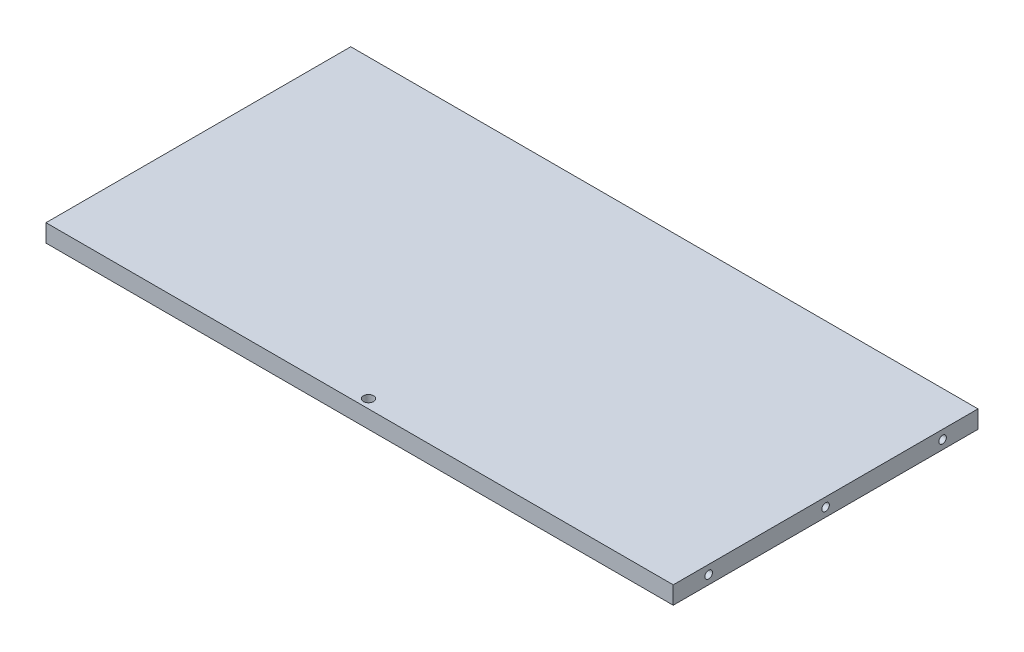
ISO-10303-21;
HEADER;
FILE_DESCRIPTION(('STEP AP214'),'2;1');
FILE_NAME('part.step','',(''),(''),'','','');
FILE_SCHEMA(('AUTOMOTIVE_DESIGN { 1 0 10303 214 1 1 1 1 }'));
ENDSEC;
DATA;
#1=APPLICATION_CONTEXT('core data for automotive mechanical design processes');
#2=APPLICATION_PROTOCOL_DEFINITION('international standard','automotive_design',2000,#1);
#3=PRODUCT_CONTEXT('',#1,'mechanical');
#4=PRODUCT('Part','Part','',(#3));
#5=PRODUCT_RELATED_PRODUCT_CATEGORY('part','',(#4));
#6=PRODUCT_DEFINITION_FORMATION('','',#4);
#7=PRODUCT_DEFINITION_CONTEXT('part definition',#1,'design');
#8=PRODUCT_DEFINITION('design','',#6,#7);
#9=PRODUCT_DEFINITION_SHAPE('','',#8);
#10=(LENGTH_UNIT() NAMED_UNIT(*) SI_UNIT(.MILLI.,.METRE.));
#11=(NAMED_UNIT(*) PLANE_ANGLE_UNIT() SI_UNIT($,.RADIAN.));
#12=(NAMED_UNIT(*) SI_UNIT($,.STERADIAN.) SOLID_ANGLE_UNIT());
#13=UNCERTAINTY_MEASURE_WITH_UNIT(LENGTH_MEASURE(1.E-05),#10,'distance_accuracy_value','');
#14=(GEOMETRIC_REPRESENTATION_CONTEXT(3) GLOBAL_UNCERTAINTY_ASSIGNED_CONTEXT((#13)) GLOBAL_UNIT_ASSIGNED_CONTEXT((#10,
#11,#12)) REPRESENTATION_CONTEXT('',''));
#15=CARTESIAN_POINT('',(0.,0.,0.));
#16=DIRECTION('',(0.,0.,1.));
#17=DIRECTION('',(1.,0.,0.));
#18=AXIS2_PLACEMENT_3D('',#15,#16,#17);
#19=CARTESIAN_POINT('',(-112.395,6.35,-54.61));
#20=DIRECTION('',(1.,0.,0.));
#21=DIRECTION('',(0.,0.,-1.));
#22=AXIS2_PLACEMENT_3D('',#19,#20,#21);
#23=PLANE('',#22);
#24=CARTESIAN_POINT('',(-112.395,3.175,41.91));
#25=DIRECTION('',(-1.,0.,0.));
#26=DIRECTION('',(0.,0.,1.));
#27=AXIS2_PLACEMENT_3D('',#24,#25,#26);
#28=CIRCLE('',#27,1.35255);
#29=CARTESIAN_POINT('',(-112.395,3.175,43.26255));
#30=VERTEX_POINT('',#29);
#31=EDGE_CURVE('E114',#30,#30,#28,.T.);
#32=ORIENTED_EDGE('',*,*,#31,.F.);
#33=EDGE_LOOP('',(#32));
#34=FACE_BOUND('',#33,.T.);
#35=CARTESIAN_POINT('',(-112.395,3.175,0.));
#36=DIRECTION('',(-1.,0.,0.));
#37=DIRECTION('',(0.,0.,1.));
#38=AXIS2_PLACEMENT_3D('',#35,#36,#37);
#39=CIRCLE('',#38,1.35255);
#40=CARTESIAN_POINT('',(-112.395,3.175,1.35255000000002));
#41=VERTEX_POINT('',#40);
#42=EDGE_CURVE('E113',#41,#41,#39,.T.);
#43=ORIENTED_EDGE('',*,*,#42,.F.);
#44=EDGE_LOOP('',(#43));
#45=FACE_BOUND('',#44,.T.);
#46=CARTESIAN_POINT('',(-112.395,3.175,-41.91));
#47=DIRECTION('',(-1.,0.,0.));
#48=DIRECTION('',(0.,0.,1.));
#49=AXIS2_PLACEMENT_3D('',#46,#47,#48);
#50=CIRCLE('',#49,1.35255);
#51=CARTESIAN_POINT('',(-112.395,3.175,-40.55745));
#52=VERTEX_POINT('',#51);
#53=EDGE_CURVE('E126',#52,#52,#50,.T.);
#54=ORIENTED_EDGE('',*,*,#53,.F.);
#55=EDGE_LOOP('',(#54));
#56=FACE_BOUND('',#55,.T.);
#57=DIRECTION('',(0.,0.,1.));
#58=VECTOR('',#57,1.);
#59=CARTESIAN_POINT('',(-112.395,0.,-54.61));
#60=LINE('',#59,#58);
#61=CARTESIAN_POINT('',(-112.395,0.,-54.61));
#62=VERTEX_POINT('',#61);
#63=CARTESIAN_POINT('',(-112.395,0.,54.61));
#64=VERTEX_POINT('',#63);
#65=EDGE_CURVE('E150',#62,#64,#60,.T.);
#66=ORIENTED_EDGE('',*,*,#65,.T.);
#67=DIRECTION('',(0.,-1.,0.));
#68=VECTOR('',#67,1.);
#69=CARTESIAN_POINT('',(-112.395,6.35,54.61));
#70=LINE('',#69,#68);
#71=CARTESIAN_POINT('',(-112.395,6.35,54.61));
#72=VERTEX_POINT('',#71);
#73=EDGE_CURVE('E11',#72,#64,#70,.T.);
#74=ORIENTED_EDGE('',*,*,#73,.F.);
#75=DIRECTION('',(0.,0.,1.));
#76=VECTOR('',#75,1.);
#77=CARTESIAN_POINT('',(-112.395,6.35,-54.61));
#78=LINE('',#77,#76);
#79=CARTESIAN_POINT('',(-112.395,6.35,-54.61));
#80=VERTEX_POINT('',#79);
#81=EDGE_CURVE('E151',#80,#72,#78,.T.);
#82=ORIENTED_EDGE('',*,*,#81,.F.);
#83=DIRECTION('',(0.,-1.,0.));
#84=VECTOR('',#83,1.);
#85=CARTESIAN_POINT('',(-112.395,6.35,-54.61));
#86=LINE('',#85,#84);
#87=EDGE_CURVE('E157',#80,#62,#86,.T.);
#88=ORIENTED_EDGE('',*,*,#87,.T.);
#89=EDGE_LOOP('',(#66,#74,#82,#88));
#90=FACE_BOUND('',#89,.T.);
#91=ADVANCED_FACE('F37',(#34,#45,#56,#90),#23,.F.);
#92=CARTESIAN_POINT('',(-112.395,6.35,54.61));
#93=DIRECTION('',(0.,0.,-1.));
#94=DIRECTION('',(-1.,0.,0.));
#95=AXIS2_PLACEMENT_3D('',#92,#93,#94);
#96=PLANE('',#95);
#97=DIRECTION('',(1.,0.,0.));
#98=VECTOR('',#97,1.);
#99=CARTESIAN_POINT('',(-112.395,0.,54.61));
#100=LINE('',#99,#98);
#101=CARTESIAN_POINT('',(112.395,0.,54.61));
#102=VERTEX_POINT('',#101);
#103=EDGE_CURVE('E160',#64,#102,#100,.T.);
#104=ORIENTED_EDGE('',*,*,#103,.T.);
#105=DIRECTION('',(0.,-1.,0.));
#106=VECTOR('',#105,1.);
#107=CARTESIAN_POINT('',(112.395,6.35,54.61));
#108=LINE('',#107,#106);
#109=CARTESIAN_POINT('',(112.395,6.35,54.61));
#110=VERTEX_POINT('',#109);
#111=EDGE_CURVE('E45',#110,#102,#108,.T.);
#112=ORIENTED_EDGE('',*,*,#111,.F.);
#113=DIRECTION('',(1.,0.,0.));
#114=VECTOR('',#113,1.);
#115=CARTESIAN_POINT('',(-112.395,6.35,54.61));
#116=LINE('',#115,#114);
#117=EDGE_CURVE('E84',#72,#110,#116,.T.);
#118=ORIENTED_EDGE('',*,*,#117,.F.);
#119=ORIENTED_EDGE('',*,*,#73,.T.);
#120=EDGE_LOOP('',(#104,#112,#118,#119));
#121=FACE_BOUND('',#120,.T.);
#122=ADVANCED_FACE('F184',(#121),#96,.F.);
#123=CARTESIAN_POINT('',(112.395,6.35,-54.61));
#124=DIRECTION('',(-1.,0.,0.));
#125=DIRECTION('',(0.,0.,1.));
#126=AXIS2_PLACEMENT_3D('',#123,#124,#125);
#127=PLANE('',#126);
#128=CARTESIAN_POINT('',(112.395,3.175,41.91));
#129=DIRECTION('',(1.,0.,0.));
#130=DIRECTION('',(0.,0.,-1.));
#131=AXIS2_PLACEMENT_3D('',#128,#129,#130);
#132=CIRCLE('',#131,1.35255);
#133=CARTESIAN_POINT('',(112.395,3.175,40.55745));
#134=VERTEX_POINT('',#133);
#135=EDGE_CURVE('E132',#134,#134,#132,.T.);
#136=ORIENTED_EDGE('',*,*,#135,.F.);
#137=EDGE_LOOP('',(#136));
#138=FACE_BOUND('',#137,.T.);
#139=CARTESIAN_POINT('',(112.395,3.175,0.));
#140=DIRECTION('',(1.,0.,0.));
#141=DIRECTION('',(0.,0.,-1.));
#142=AXIS2_PLACEMENT_3D('',#139,#140,#141);
#143=CIRCLE('',#142,1.35255);
#144=CARTESIAN_POINT('',(112.395,3.175,-1.35254999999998));
#145=VERTEX_POINT('',#144);
#146=EDGE_CURVE('E138',#145,#145,#143,.T.);
#147=ORIENTED_EDGE('',*,*,#146,.F.);
#148=EDGE_LOOP('',(#147));
#149=FACE_BOUND('',#148,.T.);
#150=CARTESIAN_POINT('',(112.395,3.175,-41.91));
#151=DIRECTION('',(1.,0.,0.));
#152=DIRECTION('',(0.,0.,-1.));
#153=AXIS2_PLACEMENT_3D('',#150,#151,#152);
#154=CIRCLE('',#153,1.35255);
#155=CARTESIAN_POINT('',(112.395,3.175,-43.26255));
#156=VERTEX_POINT('',#155);
#157=EDGE_CURVE('E144',#156,#156,#154,.T.);
#158=ORIENTED_EDGE('',*,*,#157,.F.);
#159=EDGE_LOOP('',(#158));
#160=FACE_BOUND('',#159,.T.);
#161=DIRECTION('',(0.,0.,-1.));
#162=VECTOR('',#161,1.);
#163=CARTESIAN_POINT('',(112.395,0.,-54.61));
#164=LINE('',#163,#162);
#165=CARTESIAN_POINT('',(112.395,0.,-54.61));
#166=VERTEX_POINT('',#165);
#167=EDGE_CURVE('E71',#102,#166,#164,.T.);
#168=ORIENTED_EDGE('',*,*,#167,.T.);
#169=DIRECTION('',(0.,-1.,0.));
#170=VECTOR('',#169,1.);
#171=CARTESIAN_POINT('',(112.395,6.35,-54.61));
#172=LINE('',#171,#170);
#173=CARTESIAN_POINT('',(112.395,6.35,-54.61));
#174=VERTEX_POINT('',#173);
#175=EDGE_CURVE('E165',#174,#166,#172,.T.);
#176=ORIENTED_EDGE('',*,*,#175,.F.);
#177=DIRECTION('',(0.,0.,-1.));
#178=VECTOR('',#177,1.);
#179=CARTESIAN_POINT('',(112.395,6.35,-54.61));
#180=LINE('',#179,#178);
#181=EDGE_CURVE('E154',#110,#174,#180,.T.);
#182=ORIENTED_EDGE('',*,*,#181,.F.);
#183=ORIENTED_EDGE('',*,*,#111,.T.);
#184=EDGE_LOOP('',(#168,#176,#182,#183));
#185=FACE_BOUND('',#184,.T.);
#186=ADVANCED_FACE('F167',(#138,#149,#160,#185),#127,.F.);
#187=CARTESIAN_POINT('',(-112.395,6.35,-54.61));
#188=DIRECTION('',(0.,0.,1.));
#189=DIRECTION('',(1.,0.,0.));
#190=AXIS2_PLACEMENT_3D('',#187,#188,#189);
#191=PLANE('',#190);
#192=DIRECTION('',(-1.,0.,0.));
#193=VECTOR('',#192,1.);
#194=CARTESIAN_POINT('',(-112.395,0.,-54.61));
#195=LINE('',#194,#193);
#196=EDGE_CURVE('E77',#166,#62,#195,.T.);
#197=ORIENTED_EDGE('',*,*,#196,.T.);
#198=ORIENTED_EDGE('',*,*,#87,.F.);
#199=DIRECTION('',(-1.,0.,0.));
#200=VECTOR('',#199,1.);
#201=CARTESIAN_POINT('',(-112.395,6.35,-54.61));
#202=LINE('',#201,#200);
#203=EDGE_CURVE('E53',#174,#80,#202,.T.);
#204=ORIENTED_EDGE('',*,*,#203,.F.);
#205=ORIENTED_EDGE('',*,*,#175,.T.);
#206=EDGE_LOOP('',(#197,#198,#204,#205));
#207=FACE_BOUND('',#206,.T.);
#208=ADVANCED_FACE('F174',(#207),#191,.F.);
#209=CARTESIAN_POINT('',(0.,6.35,0.));
#210=DIRECTION('',(0.,1.,0.));
#211=DIRECTION('',(0.,0.,1.));
#212=AXIS2_PLACEMENT_3D('',#209,#210,#211);
#213=PLANE('',#212);
#214=CARTESIAN_POINT('',(0.,6.35,51.435));
#215=DIRECTION('',(0.,-1.,0.));
#216=DIRECTION('',(0.,0.,-1.));
#217=AXIS2_PLACEMENT_3D('',#214,#215,#216);
#218=CIRCLE('',#217,1.8288);
#219=CARTESIAN_POINT('',(0.,6.35,49.6062));
#220=VERTEX_POINT('',#219);
#221=EDGE_CURVE('E120',#220,#220,#218,.T.);
#222=ORIENTED_EDGE('',*,*,#221,.T.);
#223=EDGE_LOOP('',(#222));
#224=FACE_BOUND('',#223,.T.);
#225=ORIENTED_EDGE('',*,*,#81,.T.);
#226=ORIENTED_EDGE('',*,*,#117,.T.);
#227=ORIENTED_EDGE('',*,*,#181,.T.);
#228=ORIENTED_EDGE('',*,*,#203,.T.);
#229=EDGE_LOOP('',(#225,#226,#227,#228));
#230=FACE_BOUND('',#229,.T.);
#231=ADVANCED_FACE('F176',(#224,#230),#213,.T.);
#232=CARTESIAN_POINT('',(0.,0.,0.));
#233=DIRECTION('',(0.,1.,0.));
#234=DIRECTION('',(0.,0.,1.));
#235=AXIS2_PLACEMENT_3D('',#232,#233,#234);
#236=PLANE('',#235);
#237=CARTESIAN_POINT('',(0.,0.,51.435));
#238=DIRECTION('',(0.,-1.,0.));
#239=DIRECTION('',(0.,0.,-1.));
#240=AXIS2_PLACEMENT_3D('',#237,#238,#239);
#241=CIRCLE('',#240,2.8575);
#242=CARTESIAN_POINT('',(0.,0.,48.5775));
#243=VERTEX_POINT('',#242);
#244=EDGE_CURVE('E245',#243,#243,#241,.T.);
#245=ORIENTED_EDGE('',*,*,#244,.F.);
#246=EDGE_LOOP('',(#245));
#247=FACE_BOUND('',#246,.T.);
#248=ORIENTED_EDGE('',*,*,#65,.F.);
#249=ORIENTED_EDGE('',*,*,#196,.F.);
#250=ORIENTED_EDGE('',*,*,#167,.F.);
#251=ORIENTED_EDGE('',*,*,#103,.F.);
#252=EDGE_LOOP('',(#248,#249,#250,#251));
#253=FACE_BOUND('',#252,.T.);
#254=ADVANCED_FACE('F170',(#247,#253),#236,.F.);
#255=CARTESIAN_POINT('',(102.997,3.175,-41.91));
#256=DIRECTION('',(1.,0.,0.));
#257=DIRECTION('',(0.,0.,-1.));
#258=AXIS2_PLACEMENT_3D('',#255,#256,#257);
#259=CONICAL_SURFACE('',#258,1.35255,1.02974425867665);
#260=CARTESIAN_POINT('',(102.184305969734,3.175,-41.91));
#261=VERTEX_POINT('',#260);
#262=VERTEX_LOOP('',#261);
#263=FACE_BOUND('',#262,.T.);
#264=CARTESIAN_POINT('',(102.997,3.175,-41.91));
#265=DIRECTION('',(1.,0.,0.));
#266=DIRECTION('',(0.,0.,-1.));
#267=AXIS2_PLACEMENT_3D('',#264,#265,#266);
#268=CIRCLE('',#267,1.35255);
#269=CARTESIAN_POINT('',(102.997,3.175,-43.26255));
#270=VERTEX_POINT('',#269);
#271=EDGE_CURVE('E147',#270,#270,#268,.T.);
#272=ORIENTED_EDGE('',*,*,#271,.T.);
#273=EDGE_LOOP('',(#272));
#274=FACE_BOUND('',#273,.T.);
#275=ADVANCED_FACE('F235',(#263,#274),#259,.F.);
#276=CARTESIAN_POINT('',(112.395,3.175,-41.91));
#277=DIRECTION('',(1.,0.,0.));
#278=DIRECTION('',(0.,0.,-1.));
#279=AXIS2_PLACEMENT_3D('',#276,#277,#278);
#280=CYLINDRICAL_SURFACE('',#279,1.35255);
#281=ORIENTED_EDGE('',*,*,#271,.F.);
#282=EDGE_LOOP('',(#281));
#283=FACE_BOUND('',#282,.T.);
#284=ORIENTED_EDGE('',*,*,#157,.T.);
#285=EDGE_LOOP('',(#284));
#286=FACE_BOUND('',#285,.T.);
#287=ADVANCED_FACE('F231',(#283,#286),#280,.F.);
#288=CARTESIAN_POINT('',(102.997,3.175,0.));
#289=DIRECTION('',(1.,0.,0.));
#290=DIRECTION('',(0.,0.,-1.));
#291=AXIS2_PLACEMENT_3D('',#288,#289,#290);
#292=CONICAL_SURFACE('',#291,1.35255,1.02974425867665);
#293=CARTESIAN_POINT('',(102.184305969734,3.175,0.));
#294=VERTEX_POINT('',#293);
#295=VERTEX_LOOP('',#294);
#296=FACE_BOUND('',#295,.T.);
#297=CARTESIAN_POINT('',(102.997,3.175,0.));
#298=DIRECTION('',(1.,0.,0.));
#299=DIRECTION('',(0.,0.,-1.));
#300=AXIS2_PLACEMENT_3D('',#297,#298,#299);
#301=CIRCLE('',#300,1.35255);
#302=CARTESIAN_POINT('',(102.997,3.175,-1.35254999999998));
#303=VERTEX_POINT('',#302);
#304=EDGE_CURVE('E141',#303,#303,#301,.T.);
#305=ORIENTED_EDGE('',*,*,#304,.T.);
#306=EDGE_LOOP('',(#305));
#307=FACE_BOUND('',#306,.T.);
#308=ADVANCED_FACE('F227',(#296,#307),#292,.F.);
#309=CARTESIAN_POINT('',(112.395,3.175,0.));
#310=DIRECTION('',(1.,0.,0.));
#311=DIRECTION('',(0.,0.,-1.));
#312=AXIS2_PLACEMENT_3D('',#309,#310,#311);
#313=CYLINDRICAL_SURFACE('',#312,1.35255);
#314=ORIENTED_EDGE('',*,*,#304,.F.);
#315=EDGE_LOOP('',(#314));
#316=FACE_BOUND('',#315,.T.);
#317=ORIENTED_EDGE('',*,*,#146,.T.);
#318=EDGE_LOOP('',(#317));
#319=FACE_BOUND('',#318,.T.);
#320=ADVANCED_FACE('F223',(#316,#319),#313,.F.);
#321=CARTESIAN_POINT('',(102.997,3.175,41.91));
#322=DIRECTION('',(1.,0.,0.));
#323=DIRECTION('',(0.,0.,-1.));
#324=AXIS2_PLACEMENT_3D('',#321,#322,#323);
#325=CONICAL_SURFACE('',#324,1.35255,1.02974425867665);
#326=CARTESIAN_POINT('',(102.184305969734,3.175,41.91));
#327=VERTEX_POINT('',#326);
#328=VERTEX_LOOP('',#327);
#329=FACE_BOUND('',#328,.T.);
#330=CARTESIAN_POINT('',(102.997,3.175,41.91));
#331=DIRECTION('',(1.,0.,0.));
#332=DIRECTION('',(0.,0.,-1.));
#333=AXIS2_PLACEMENT_3D('',#330,#331,#332);
#334=CIRCLE('',#333,1.35255);
#335=CARTESIAN_POINT('',(102.997,3.175,40.55745));
#336=VERTEX_POINT('',#335);
#337=EDGE_CURVE('E135',#336,#336,#334,.T.);
#338=ORIENTED_EDGE('',*,*,#337,.T.);
#339=EDGE_LOOP('',(#338));
#340=FACE_BOUND('',#339,.T.);
#341=ADVANCED_FACE('F219',(#329,#340),#325,.F.);
#342=CARTESIAN_POINT('',(112.395,3.175,41.91));
#343=DIRECTION('',(1.,0.,0.));
#344=DIRECTION('',(0.,0.,-1.));
#345=AXIS2_PLACEMENT_3D('',#342,#343,#344);
#346=CYLINDRICAL_SURFACE('',#345,1.35255);
#347=ORIENTED_EDGE('',*,*,#337,.F.);
#348=EDGE_LOOP('',(#347));
#349=FACE_BOUND('',#348,.T.);
#350=ORIENTED_EDGE('',*,*,#135,.T.);
#351=EDGE_LOOP('',(#350));
#352=FACE_BOUND('',#351,.T.);
#353=ADVANCED_FACE('F211',(#349,#352),#346,.F.);
#354=CARTESIAN_POINT('',(-102.997,3.175,-41.91));
#355=DIRECTION('',(-1.,0.,0.));
#356=DIRECTION('',(0.,0.,1.));
#357=AXIS2_PLACEMENT_3D('',#354,#355,#356);
#358=CONICAL_SURFACE('',#357,1.35255,1.02974425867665);
#359=CARTESIAN_POINT('',(-102.184305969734,3.175,-41.91));
#360=VERTEX_POINT('',#359);
#361=VERTEX_LOOP('',#360);
#362=FACE_BOUND('',#361,.T.);
#363=CARTESIAN_POINT('',(-102.997,3.175,-41.91));
#364=DIRECTION('',(-1.,0.,0.));
#365=DIRECTION('',(0.,0.,1.));
#366=AXIS2_PLACEMENT_3D('',#363,#364,#365);
#367=CIRCLE('',#366,1.35255);
#368=CARTESIAN_POINT('',(-102.997,3.175,-40.55745));
#369=VERTEX_POINT('',#368);
#370=EDGE_CURVE('E129',#369,#369,#367,.T.);
#371=ORIENTED_EDGE('',*,*,#370,.T.);
#372=EDGE_LOOP('',(#371));
#373=FACE_BOUND('',#372,.T.);
#374=ADVANCED_FACE('F202',(#362,#373),#358,.F.);
#375=CARTESIAN_POINT('',(-112.395,3.175,-41.91));
#376=DIRECTION('',(-1.,0.,0.));
#377=DIRECTION('',(0.,0.,1.));
#378=AXIS2_PLACEMENT_3D('',#375,#376,#377);
#379=CYLINDRICAL_SURFACE('',#378,1.35255);
#380=ORIENTED_EDGE('',*,*,#370,.F.);
#381=EDGE_LOOP('',(#380));
#382=FACE_BOUND('',#381,.T.);
#383=ORIENTED_EDGE('',*,*,#53,.T.);
#384=EDGE_LOOP('',(#383));
#385=FACE_BOUND('',#384,.T.);
#386=ADVANCED_FACE('F199',(#382,#385),#379,.F.);
#387=CARTESIAN_POINT('',(-102.997,3.175,0.));
#388=DIRECTION('',(-1.,0.,0.));
#389=DIRECTION('',(0.,0.,1.));
#390=AXIS2_PLACEMENT_3D('',#387,#388,#389);
#391=CONICAL_SURFACE('',#390,1.35255,1.02974425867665);
#392=CARTESIAN_POINT('',(-102.184305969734,3.175,0.));
#393=VERTEX_POINT('',#392);
#394=VERTEX_LOOP('',#393);
#395=FACE_BOUND('',#394,.T.);
#396=CARTESIAN_POINT('',(-102.997,3.175,0.));
#397=DIRECTION('',(-1.,0.,0.));
#398=DIRECTION('',(0.,0.,1.));
#399=AXIS2_PLACEMENT_3D('',#396,#397,#398);
#400=CIRCLE('',#399,1.35255);
#401=CARTESIAN_POINT('',(-102.997,3.175,1.35255000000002));
#402=VERTEX_POINT('',#401);
#403=EDGE_CURVE('E117',#402,#402,#400,.T.);
#404=ORIENTED_EDGE('',*,*,#403,.T.);
#405=EDGE_LOOP('',(#404));
#406=FACE_BOUND('',#405,.T.);
#407=ADVANCED_FACE('F201',(#395,#406),#391,.F.);
#408=CARTESIAN_POINT('',(-112.395,3.175,0.));
#409=DIRECTION('',(-1.,0.,0.));
#410=DIRECTION('',(0.,0.,1.));
#411=AXIS2_PLACEMENT_3D('',#408,#409,#410);
#412=CYLINDRICAL_SURFACE('',#411,1.35255);
#413=ORIENTED_EDGE('',*,*,#403,.F.);
#414=EDGE_LOOP('',(#413));
#415=FACE_BOUND('',#414,.T.);
#416=ORIENTED_EDGE('',*,*,#42,.T.);
#417=EDGE_LOOP('',(#416));
#418=FACE_BOUND('',#417,.T.);
#419=ADVANCED_FACE('F107',(#415,#418),#412,.F.);
#420=CARTESIAN_POINT('',(-102.997,3.175,41.91));
#421=DIRECTION('',(-1.,0.,0.));
#422=DIRECTION('',(0.,0.,1.));
#423=AXIS2_PLACEMENT_3D('',#420,#421,#422);
#424=CONICAL_SURFACE('',#423,1.35255,1.02974425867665);
#425=CARTESIAN_POINT('',(-102.184305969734,3.175,41.91));
#426=VERTEX_POINT('',#425);
#427=VERTEX_LOOP('',#426);
#428=FACE_BOUND('',#427,.T.);
#429=CARTESIAN_POINT('',(-102.997,3.175,41.91));
#430=DIRECTION('',(-1.,0.,0.));
#431=DIRECTION('',(0.,0.,1.));
#432=AXIS2_PLACEMENT_3D('',#429,#430,#431);
#433=CIRCLE('',#432,1.35255);
#434=CARTESIAN_POINT('',(-102.997,3.175,43.26255));
#435=VERTEX_POINT('',#434);
#436=EDGE_CURVE('E111',#435,#435,#433,.T.);
#437=ORIENTED_EDGE('',*,*,#436,.T.);
#438=EDGE_LOOP('',(#437));
#439=FACE_BOUND('',#438,.T.);
#440=ADVANCED_FACE('F103',(#428,#439),#424,.F.);
#441=CARTESIAN_POINT('',(-112.395,3.175,41.91));
#442=DIRECTION('',(-1.,0.,0.));
#443=DIRECTION('',(0.,0.,1.));
#444=AXIS2_PLACEMENT_3D('',#441,#442,#443);
#445=CYLINDRICAL_SURFACE('',#444,1.35255);
#446=ORIENTED_EDGE('',*,*,#436,.F.);
#447=EDGE_LOOP('',(#446));
#448=FACE_BOUND('',#447,.T.);
#449=ORIENTED_EDGE('',*,*,#31,.T.);
#450=EDGE_LOOP('',(#449));
#451=FACE_BOUND('',#450,.T.);
#452=ADVANCED_FACE('F106',(#448,#451),#445,.F.);
#453=CARTESIAN_POINT('',(0.,0.,51.435));
#454=DIRECTION('',(0.,-1.,0.));
#455=DIRECTION('',(0.,0.,-1.));
#456=AXIS2_PLACEMENT_3D('',#453,#454,#455);
#457=CYLINDRICAL_SURFACE('',#456,1.8288);
#458=ORIENTED_EDGE('',*,*,#221,.F.);
#459=EDGE_LOOP('',(#458));
#460=FACE_BOUND('',#459,.T.);
#461=CARTESIAN_POINT('',(0.,3.5052,51.435));
#462=DIRECTION('',(0.,-1.,0.));
#463=DIRECTION('',(0.,0.,-1.));
#464=AXIS2_PLACEMENT_3D('',#461,#462,#463);
#465=CIRCLE('',#464,1.8288);
#466=CARTESIAN_POINT('',(0.,3.5052,49.6062));
#467=VERTEX_POINT('',#466);
#468=EDGE_CURVE('E250',#467,#467,#465,.T.);
#469=ORIENTED_EDGE('',*,*,#468,.T.);
#470=EDGE_LOOP('',(#469));
#471=FACE_BOUND('',#470,.T.);
#472=ADVANCED_FACE('F257',(#460,#471),#457,.F.);
#473=CARTESIAN_POINT('',(1.82879999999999,3.5052,51.435));
#474=DIRECTION('',(0.,1.,0.));
#475=DIRECTION('',(0.,0.,1.));
#476=AXIS2_PLACEMENT_3D('',#473,#474,#475);
#477=PLANE('',#476);
#478=ORIENTED_EDGE('',*,*,#468,.F.);
#479=EDGE_LOOP('',(#478));
#480=FACE_BOUND('',#479,.T.);
#481=CARTESIAN_POINT('',(0.,3.5052,51.435));
#482=DIRECTION('',(0.,-1.,0.));
#483=DIRECTION('',(0.,0.,-1.));
#484=AXIS2_PLACEMENT_3D('',#481,#482,#483);
#485=CIRCLE('',#484,2.8575);
#486=CARTESIAN_POINT('',(0.,3.5052,48.5775));
#487=VERTEX_POINT('',#486);
#488=EDGE_CURVE('E247',#487,#487,#485,.T.);
#489=ORIENTED_EDGE('',*,*,#488,.T.);
#490=EDGE_LOOP('',(#489));
#491=FACE_BOUND('',#490,.T.);
#492=ADVANCED_FACE('F260',(#480,#491),#477,.F.);
#493=CARTESIAN_POINT('',(0.,0.,51.435));
#494=DIRECTION('',(0.,-1.,0.));
#495=DIRECTION('',(0.,0.,-1.));
#496=AXIS2_PLACEMENT_3D('',#493,#494,#495);
#497=CYLINDRICAL_SURFACE('',#496,2.8575);
#498=ORIENTED_EDGE('',*,*,#488,.F.);
#499=EDGE_LOOP('',(#498));
#500=FACE_BOUND('',#499,.T.);
#501=ORIENTED_EDGE('',*,*,#244,.T.);
#502=EDGE_LOOP('',(#501));
#503=FACE_BOUND('',#502,.T.);
#504=ADVANCED_FACE('F266',(#500,#503),#497,.F.);
#505=CLOSED_SHELL('',(#91,#122,#186,#208,#231,#254,#275,#287,#308,#320,#341,#353,#374,#386,#407,
#419,#440,#452,#472,#492,#504));
#506=MANIFOLD_SOLID_BREP('B2',#505);
#507=ADVANCED_BREP_SHAPE_REPRESENTATION('',(#18,#506),#14);
#508=SHAPE_DEFINITION_REPRESENTATION(#9,#507);
ENDSEC;
END-ISO-10303-21;
